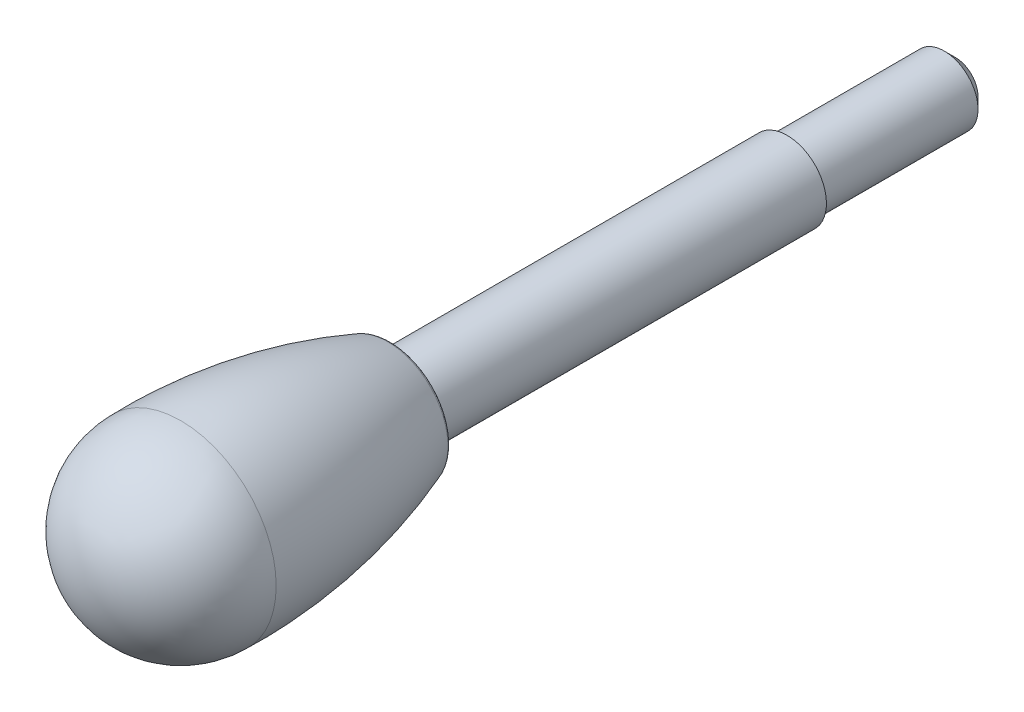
ISO-10303-21;
HEADER;
FILE_DESCRIPTION(('STEP AP214'),'2;1');
FILE_NAME('part.step','',(''),(''),'','','');
FILE_SCHEMA(('AUTOMOTIVE_DESIGN { 1 0 10303 214 1 1 1 1 }'));
ENDSEC;
DATA;
#1=APPLICATION_CONTEXT('core data for automotive mechanical design processes');
#2=APPLICATION_PROTOCOL_DEFINITION('international standard','automotive_design',2000,#1);
#3=PRODUCT_CONTEXT('',#1,'mechanical');
#4=PRODUCT('Part','Part','',(#3));
#5=PRODUCT_RELATED_PRODUCT_CATEGORY('part','',(#4));
#6=PRODUCT_DEFINITION_FORMATION('','',#4);
#7=PRODUCT_DEFINITION_CONTEXT('part definition',#1,'design');
#8=PRODUCT_DEFINITION('design','',#6,#7);
#9=PRODUCT_DEFINITION_SHAPE('','',#8);
#10=(LENGTH_UNIT() NAMED_UNIT(*) SI_UNIT(.MILLI.,.METRE.));
#11=(NAMED_UNIT(*) PLANE_ANGLE_UNIT() SI_UNIT($,.RADIAN.));
#12=(NAMED_UNIT(*) SI_UNIT($,.STERADIAN.) SOLID_ANGLE_UNIT());
#13=UNCERTAINTY_MEASURE_WITH_UNIT(LENGTH_MEASURE(1.E-05),#10,'distance_accuracy_value','');
#14=(GEOMETRIC_REPRESENTATION_CONTEXT(3) GLOBAL_UNCERTAINTY_ASSIGNED_CONTEXT((#13)) GLOBAL_UNIT_ASSIGNED_CONTEXT((#10,
#11,#12)) REPRESENTATION_CONTEXT('',''));
#15=CARTESIAN_POINT('',(0.,0.,0.));
#16=DIRECTION('',(0.,0.,1.));
#17=DIRECTION('',(1.,0.,0.));
#18=AXIS2_PLACEMENT_3D('',#15,#16,#17);
#19=CARTESIAN_POINT('',(0.,6.,0.));
#20=DIRECTION('',(0.,0.,1.));
#21=DIRECTION('',(0.,1.,0.));
#22=AXIS2_PLACEMENT_3D('',#19,#20,#21);
#23=PLANE('',#22);
#24=CARTESIAN_POINT('',(0.,0.,0.));
#25=DIRECTION('',(0.,0.,-1.));
#26=DIRECTION('',(0.,-1.,0.));
#27=AXIS2_PLACEMENT_3D('',#24,#25,#26);
#28=CIRCLE('',#27,6.);
#29=CARTESIAN_POINT('',(0.,-6.,0.));
#30=VERTEX_POINT('',#29);
#31=EDGE_CURVE('E8',#30,#30,#28,.T.);
#32=ORIENTED_EDGE('',*,*,#31,.F.);
#33=EDGE_LOOP('',(#32));
#34=FACE_BOUND('',#33,.T.);
#35=CARTESIAN_POINT('',(0.,0.,0.));
#36=DIRECTION('',(0.,0.,-1.));
#37=DIRECTION('',(0.,-1.,0.));
#38=AXIS2_PLACEMENT_3D('',#35,#36,#37);
#39=CIRCLE('',#38,7.);
#40=CARTESIAN_POINT('',(0.,-7.,0.));
#41=VERTEX_POINT('',#40);
#42=EDGE_CURVE('E40',#41,#41,#39,.T.);
#43=ORIENTED_EDGE('',*,*,#42,.T.);
#44=EDGE_LOOP('',(#43));
#45=FACE_BOUND('',#44,.T.);
#46=ADVANCED_FACE('F12',(#34,#45),#23,.F.);
#47=CARTESIAN_POINT('',(0.,0.,-35.));
#48=DIRECTION('',(0.,0.,-1.));
#49=DIRECTION('',(0.,-1.,0.));
#50=AXIS2_PLACEMENT_3D('',#47,#48,#49);
#51=CYLINDRICAL_SURFACE('',#50,6.);
#52=CARTESIAN_POINT('',(0.,0.,-28.));
#53=DIRECTION('',(0.,0.,-1.));
#54=DIRECTION('',(0.,-1.,0.));
#55=AXIS2_PLACEMENT_3D('',#52,#53,#54);
#56=CIRCLE('',#55,6.);
#57=CARTESIAN_POINT('',(0.,-5.99999999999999,-28.));
#58=VERTEX_POINT('',#57);
#59=EDGE_CURVE('E18',#58,#58,#56,.T.);
#60=ORIENTED_EDGE('',*,*,#59,.F.);
#61=EDGE_LOOP('',(#60));
#62=FACE_BOUND('',#61,.T.);
#63=ORIENTED_EDGE('',*,*,#31,.T.);
#64=EDGE_LOOP('',(#63));
#65=FACE_BOUND('',#64,.T.);
#66=ADVANCED_FACE('F82',(#62,#65),#51,.T.);
#67=CARTESIAN_POINT('',(0.,0.,-28.));
#68=DIRECTION('',(0.,0.,1.));
#69=DIRECTION('',(0.,1.,0.));
#70=AXIS2_PLACEMENT_3D('',#67,#68,#69);
#71=CONICAL_SURFACE('',#70,6.,0.78539816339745);
#72=CARTESIAN_POINT('',(0.,0.,-30.));
#73=DIRECTION('',(0.,0.,-1.));
#74=DIRECTION('',(0.,-1.,0.));
#75=AXIS2_PLACEMENT_3D('',#72,#73,#74);
#76=CIRCLE('',#75,4.);
#77=CARTESIAN_POINT('',(0.,-3.99999999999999,-30.));
#78=VERTEX_POINT('',#77);
#79=EDGE_CURVE('E22',#78,#78,#76,.T.);
#80=ORIENTED_EDGE('',*,*,#79,.F.);
#81=EDGE_LOOP('',(#80));
#82=FACE_BOUND('',#81,.T.);
#83=ORIENTED_EDGE('',*,*,#59,.T.);
#84=EDGE_LOOP('',(#83));
#85=FACE_BOUND('',#84,.T.);
#86=ADVANCED_FACE('F78',(#82,#85),#71,.T.);
#87=CARTESIAN_POINT('',(0.,0.,-30.));
#88=DIRECTION('',(0.,0.,1.));
#89=DIRECTION('',(0.,1.,0.));
#90=AXIS2_PLACEMENT_3D('',#87,#88,#89);
#91=PLANE('',#90);
#92=ORIENTED_EDGE('',*,*,#79,.T.);
#93=EDGE_LOOP('',(#92));
#94=FACE_BOUND('',#93,.T.);
#95=ADVANCED_FACE('F71',(#94),#91,.F.);
#96=CARTESIAN_POINT('',(0.,0.,108.));
#97=DIRECTION('',(0.,0.,-1.));
#98=DIRECTION('',(0.,1.,0.));
#99=AXIS2_PLACEMENT_3D('',#96,#97,#98);
#100=SPHERICAL_SURFACE('',#99,17.);
#101=CARTESIAN_POINT('',(0.,0.,107.999999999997));
#102=DIRECTION('',(0.,0.,-1.));
#103=DIRECTION('',(0.,-1.,0.));
#104=AXIS2_PLACEMENT_3D('',#101,#102,#103);
#105=CIRCLE('',#104,17.);
#106=CARTESIAN_POINT('',(0.,-17.,107.999999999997));
#107=VERTEX_POINT('',#106);
#108=EDGE_CURVE('E26',#107,#107,#105,.T.);
#109=ORIENTED_EDGE('',*,*,#108,.F.);
#110=EDGE_LOOP('',(#109));
#111=FACE_BOUND('',#110,.T.);
#112=ADVANCED_FACE('F66',(#111),#100,.T.);
#113=CARTESIAN_POINT('',(0.,0.,106.103564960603));
#114=DIRECTION('',(0.,0.,-1.));
#115=DIRECTION('',(0.,-1.,0.));
#116=AXIS2_PLACEMENT_3D('',#113,#114,#115);
#117=DEGENERATE_TOROIDAL_SURFACE('',#116,83.4821055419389,100.5,.F.);
#118=CARTESIAN_POINT('',(0.,0.,71.1522254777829));
#119=DIRECTION('',(0.,0.,-1.));
#120=DIRECTION('',(0.,-1.,0.));
#121=AXIS2_PLACEMENT_3D('',#118,#119,#120);
#122=CIRCLE('',#121,10.7445035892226);
#123=CARTESIAN_POINT('',(0.,-10.7445035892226,71.1522254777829));
#124=VERTEX_POINT('',#123);
#125=EDGE_CURVE('E31',#124,#124,#122,.T.);
#126=ORIENTED_EDGE('',*,*,#125,.F.);
#127=EDGE_LOOP('',(#126));
#128=FACE_BOUND('',#127,.T.);
#129=ORIENTED_EDGE('',*,*,#108,.T.);
#130=EDGE_LOOP('',(#129));
#131=FACE_BOUND('',#130,.T.);
#132=ADVANCED_FACE('F60',(#128,#131),#117,.F.);
#133=CARTESIAN_POINT('',(0.,0.,71.5));
#134=DIRECTION('',(0.,0.,-1.));
#135=DIRECTION('',(0.,-1.,0.));
#136=AXIS2_PLACEMENT_3D('',#133,#134,#135);
#137=TOROIDAL_SURFACE('',#136,9.80692538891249,0.999999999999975);
#138=CARTESIAN_POINT('',(0.,0.,70.5));
#139=DIRECTION('',(0.,0.,-1.));
#140=DIRECTION('',(0.,-1.,0.));
#141=AXIS2_PLACEMENT_3D('',#138,#139,#140);
#142=CIRCLE('',#141,9.80692538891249);
#143=CARTESIAN_POINT('',(0.,-9.80692538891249,70.5));
#144=VERTEX_POINT('',#143);
#145=EDGE_CURVE('E34',#144,#144,#142,.T.);
#146=ORIENTED_EDGE('',*,*,#145,.F.);
#147=EDGE_LOOP('',(#146));
#148=FACE_BOUND('',#147,.T.);
#149=ORIENTED_EDGE('',*,*,#125,.T.);
#150=EDGE_LOOP('',(#149));
#151=FACE_BOUND('',#150,.T.);
#152=ADVANCED_FACE('F54',(#148,#151),#137,.T.);
#153=CARTESIAN_POINT('',(0.,7.,70.5));
#154=DIRECTION('',(0.,0.,1.));
#155=DIRECTION('',(0.,1.,0.));
#156=AXIS2_PLACEMENT_3D('',#153,#154,#155);
#157=PLANE('',#156);
#158=CARTESIAN_POINT('',(0.,0.,70.5));
#159=DIRECTION('',(0.,0.,-1.));
#160=DIRECTION('',(0.,-1.,0.));
#161=AXIS2_PLACEMENT_3D('',#158,#159,#160);
#162=CIRCLE('',#161,7.);
#163=CARTESIAN_POINT('',(0.,-7.,70.5));
#164=VERTEX_POINT('',#163);
#165=EDGE_CURVE('E37',#164,#164,#162,.T.);
#166=ORIENTED_EDGE('',*,*,#165,.F.);
#167=EDGE_LOOP('',(#166));
#168=FACE_BOUND('',#167,.T.);
#169=ORIENTED_EDGE('',*,*,#145,.T.);
#170=EDGE_LOOP('',(#169));
#171=FACE_BOUND('',#170,.T.);
#172=ADVANCED_FACE('F48',(#168,#171),#157,.F.);
#173=CARTESIAN_POINT('',(0.,0.,-35.));
#174=DIRECTION('',(0.,0.,-1.));
#175=DIRECTION('',(0.,-1.,0.));
#176=AXIS2_PLACEMENT_3D('',#173,#174,#175);
#177=CYLINDRICAL_SURFACE('',#176,7.);
#178=ORIENTED_EDGE('',*,*,#42,.F.);
#179=EDGE_LOOP('',(#178));
#180=FACE_BOUND('',#179,.T.);
#181=ORIENTED_EDGE('',*,*,#165,.T.);
#182=EDGE_LOOP('',(#181));
#183=FACE_BOUND('',#182,.T.);
#184=ADVANCED_FACE('F45',(#180,#183),#177,.T.);
#185=CLOSED_SHELL('',(#46,#66,#86,#95,#112,#132,#152,#172,#184));
#186=MANIFOLD_SOLID_BREP('B1',#185);
#187=ADVANCED_BREP_SHAPE_REPRESENTATION('',(#18,#186),#14);
#188=SHAPE_DEFINITION_REPRESENTATION(#9,#187);
ENDSEC;
END-ISO-10303-21;
